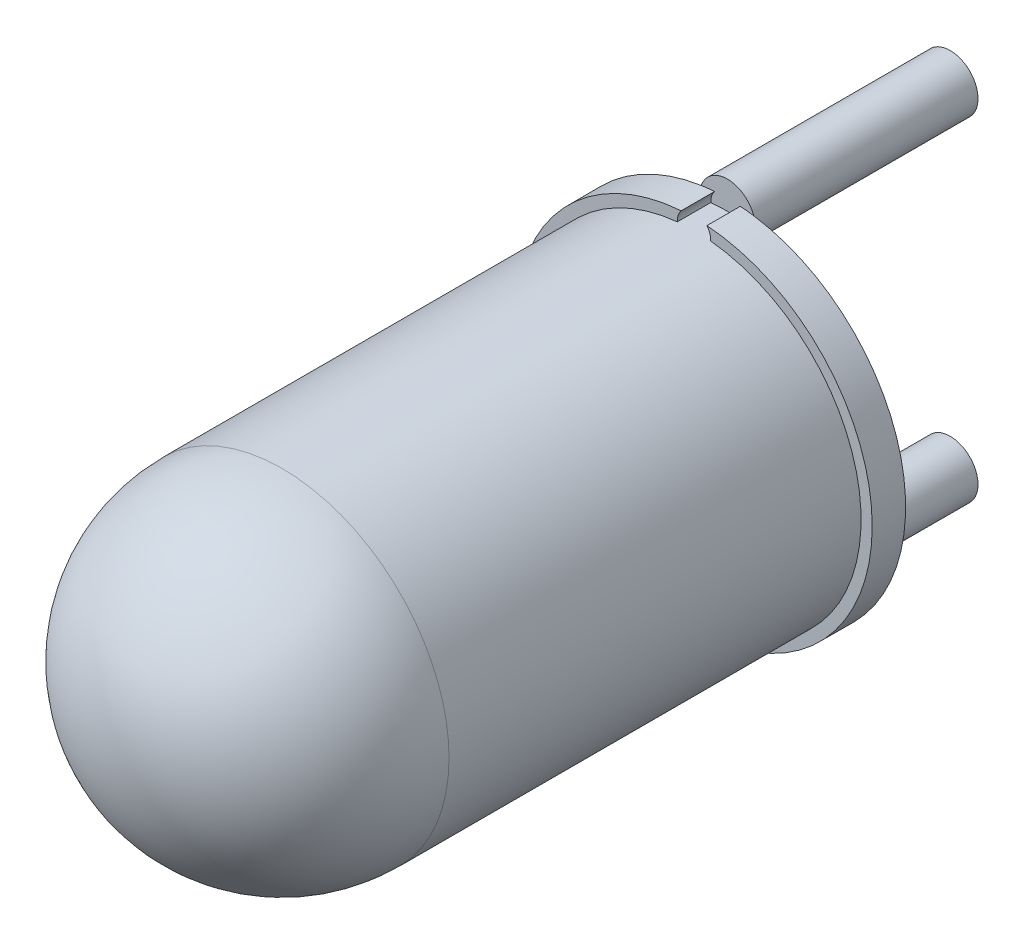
ISO-10303-21;
HEADER;
FILE_DESCRIPTION(('STEP AP214'),'2;1');
FILE_NAME('part.step','',(''),(''),'','','');
FILE_SCHEMA(('AUTOMOTIVE_DESIGN { 1 0 10303 214 1 1 1 1 }'));
ENDSEC;
DATA;
#1=APPLICATION_CONTEXT('core data for automotive mechanical design processes');
#2=APPLICATION_PROTOCOL_DEFINITION('international standard','automotive_design',2000,#1);
#3=PRODUCT_CONTEXT('',#1,'mechanical');
#4=PRODUCT('Part','Part','',(#3));
#5=PRODUCT_RELATED_PRODUCT_CATEGORY('part','',(#4));
#6=PRODUCT_DEFINITION_FORMATION('','',#4);
#7=PRODUCT_DEFINITION_CONTEXT('part definition',#1,'design');
#8=PRODUCT_DEFINITION('design','',#6,#7);
#9=PRODUCT_DEFINITION_SHAPE('','',#8);
#10=(LENGTH_UNIT() NAMED_UNIT(*) SI_UNIT(.MILLI.,.METRE.));
#11=(NAMED_UNIT(*) PLANE_ANGLE_UNIT() SI_UNIT($,.RADIAN.));
#12=(NAMED_UNIT(*) SI_UNIT($,.STERADIAN.) SOLID_ANGLE_UNIT());
#13=UNCERTAINTY_MEASURE_WITH_UNIT(LENGTH_MEASURE(1.E-05),#10,'distance_accuracy_value','');
#14=(GEOMETRIC_REPRESENTATION_CONTEXT(3) GLOBAL_UNCERTAINTY_ASSIGNED_CONTEXT((#13)) GLOBAL_UNIT_ASSIGNED_CONTEXT((#10,
#11,#12)) REPRESENTATION_CONTEXT('',''));
#15=CARTESIAN_POINT('',(0.,0.,0.));
#16=DIRECTION('',(0.,0.,1.));
#17=DIRECTION('',(1.,0.,0.));
#18=AXIS2_PLACEMENT_3D('',#15,#16,#17);
#19=CARTESIAN_POINT('',(0.,0.,4.));
#20=DIRECTION('',(0.,0.,-1.));
#21=DIRECTION('',(-1.,0.,0.));
#22=AXIS2_PLACEMENT_3D('',#19,#20,#21);
#23=CYLINDRICAL_SURFACE('',#22,1.5);
#24=CARTESIAN_POINT('',(0.,0.,4.));
#25=DIRECTION('',(0.,0.,1.));
#26=DIRECTION('',(1.,0.,0.));
#27=AXIS2_PLACEMENT_3D('',#24,#25,#26);
#28=CIRCLE('',#27,1.5);
#29=CARTESIAN_POINT('',(1.5,0.,4.));
#30=VERTEX_POINT('',#29);
#31=EDGE_CURVE('E162',#30,#30,#28,.T.);
#32=ORIENTED_EDGE('',*,*,#31,.F.);
#33=EDGE_LOOP('',(#32));
#34=FACE_BOUND('',#33,.T.);
#35=DIRECTION('',(0.,0.,-1.));
#36=VECTOR('',#35,1.);
#37=CARTESIAN_POINT('',(0.149812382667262,1.49249999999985,0.15));
#38=LINE('',#37,#36);
#39=CARTESIAN_POINT('',(0.149812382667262,1.49249999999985,0.));
#40=VERTEX_POINT('',#39);
#41=CARTESIAN_POINT('',(0.149812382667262,1.49249999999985,0.3));
#42=VERTEX_POINT('',#41);
#43=EDGE_CURVE('E178',#40,#42,#38,.F.);
#44=ORIENTED_EDGE('',*,*,#43,.F.);
#45=CARTESIAN_POINT('',(0.,0.,0.));
#46=DIRECTION('',(0.,0.,1.));
#47=DIRECTION('',(1.,0.,0.));
#48=AXIS2_PLACEMENT_3D('',#45,#46,#47);
#49=CIRCLE('',#48,1.5);
#50=CARTESIAN_POINT('',(-0.149812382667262,1.49249999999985,0.));
#51=VERTEX_POINT('',#50);
#52=EDGE_CURVE('E163',#40,#51,#49,.T.);
#53=ORIENTED_EDGE('',*,*,#52,.T.);
#54=DIRECTION('',(0.,0.,-1.));
#55=VECTOR('',#54,1.);
#56=CARTESIAN_POINT('',(-0.149812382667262,1.49249999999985,0.15));
#57=LINE('',#56,#55);
#58=CARTESIAN_POINT('',(-0.149812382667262,1.49249999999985,0.3));
#59=VERTEX_POINT('',#58);
#60=EDGE_CURVE('E181',#59,#51,#57,.T.);
#61=ORIENTED_EDGE('',*,*,#60,.F.);
#62=CARTESIAN_POINT('',(0.,0.,0.3));
#63=DIRECTION('',(0.,0.,-1.));
#64=DIRECTION('',(-1.,0.,0.));
#65=AXIS2_PLACEMENT_3D('',#62,#63,#64);
#66=CIRCLE('',#65,1.5);
#67=CARTESIAN_POINT('',(-0.149812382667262,-1.49249999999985,0.3));
#68=VERTEX_POINT('',#67);
#69=EDGE_CURVE('E11',#68,#59,#66,.T.);
#70=ORIENTED_EDGE('',*,*,#69,.F.);
#71=DIRECTION('',(0.,0.,-1.));
#72=VECTOR('',#71,1.);
#73=CARTESIAN_POINT('',(-0.149812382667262,-1.49249999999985,0.15));
#74=LINE('',#73,#72);
#75=CARTESIAN_POINT('',(-0.149812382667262,-1.49249999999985,0.));
#76=VERTEX_POINT('',#75);
#77=EDGE_CURVE('E153',#76,#68,#74,.F.);
#78=ORIENTED_EDGE('',*,*,#77,.F.);
#79=CARTESIAN_POINT('',(0.149812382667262,-1.49249999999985,0.));
#80=VERTEX_POINT('',#79);
#81=EDGE_CURVE('E158',#76,#80,#49,.T.);
#82=ORIENTED_EDGE('',*,*,#81,.T.);
#83=DIRECTION('',(0.,0.,-1.));
#84=VECTOR('',#83,1.);
#85=CARTESIAN_POINT('',(0.149812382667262,-1.49249999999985,0.15));
#86=LINE('',#85,#84);
#87=CARTESIAN_POINT('',(0.149812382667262,-1.49249999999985,0.3));
#88=VERTEX_POINT('',#87);
#89=EDGE_CURVE('E109',#88,#80,#86,.T.);
#90=ORIENTED_EDGE('',*,*,#89,.F.);
#91=EDGE_CURVE('E32',#42,#88,#66,.T.);
#92=ORIENTED_EDGE('',*,*,#91,.F.);
#93=EDGE_LOOP('',(#44,#53,#61,#70,#78,#82,#90,#92));
#94=FACE_BOUND('',#93,.T.);
#95=ADVANCED_FACE('F29',(#34,#94),#23,.T.);
#96=CARTESIAN_POINT('',(0.,1.5,0.));
#97=DIRECTION('',(0.,0.,-1.));
#98=DIRECTION('',(-1.,0.,0.));
#99=AXIS2_PLACEMENT_3D('',#96,#97,#98);
#100=PLANE('',#99);
#101=CARTESIAN_POINT('',(0.,1.5,0.));
#102=DIRECTION('',(0.,0.,-1.));
#103=DIRECTION('',(-1.,0.,0.));
#104=AXIS2_PLACEMENT_3D('',#101,#102,#103);
#105=CIRCLE('',#104,0.150000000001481);
#106=CARTESIAN_POINT('',(0.115394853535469,1.59583333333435,0.));
#107=VERTEX_POINT('',#106);
#108=EDGE_CURVE('E196',#107,#40,#105,.T.);
#109=ORIENTED_EDGE('',*,*,#108,.F.);
#110=CARTESIAN_POINT('',(0.,0.,0.));
#111=DIRECTION('',(0.,0.,-1.));
#112=DIRECTION('',(-1.,0.,0.));
#113=AXIS2_PLACEMENT_3D('',#110,#111,#112);
#114=CIRCLE('',#113,1.60000000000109);
#115=CARTESIAN_POINT('',(0.235995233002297,1.58250000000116,0.));
#116=VERTEX_POINT('',#115);
#117=EDGE_CURVE('E115',#107,#116,#114,.T.);
#118=ORIENTED_EDGE('',*,*,#117,.T.);
#119=CARTESIAN_POINT('',(0.,1.5,0.));
#120=DIRECTION('',(0.,0.,-1.));
#121=DIRECTION('',(-1.,0.,0.));
#122=AXIS2_PLACEMENT_3D('',#119,#120,#121);
#123=CIRCLE('',#122,0.25);
#124=CARTESIAN_POINT('',(-0.235995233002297,1.58250000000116,0.));
#125=VERTEX_POINT('',#124);
#126=EDGE_CURVE('E160',#125,#116,#123,.T.);
#127=ORIENTED_EDGE('',*,*,#126,.F.);
#128=CARTESIAN_POINT('',(-0.11539485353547,1.59583333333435,0.));
#129=VERTEX_POINT('',#128);
#130=EDGE_CURVE('E139',#125,#129,#114,.T.);
#131=ORIENTED_EDGE('',*,*,#130,.T.);
#132=EDGE_CURVE('E143',#51,#129,#105,.T.);
#133=ORIENTED_EDGE('',*,*,#132,.F.);
#134=ORIENTED_EDGE('',*,*,#52,.F.);
#135=EDGE_LOOP('',(#109,#118,#127,#131,#133,#134));
#136=FACE_BOUND('',#135,.T.);
#137=ADVANCED_FACE('F209',(#136),#100,.F.);
#138=CARTESIAN_POINT('',(0.,0.,0.));
#139=DIRECTION('',(0.,0.,1.));
#140=DIRECTION('',(1.,0.,0.));
#141=AXIS2_PLACEMENT_3D('',#138,#139,#140);
#142=PLANE('',#141);
#143=EDGE_CURVE('E42',#116,#125,#123,.T.);
#144=ORIENTED_EDGE('',*,*,#143,.F.);
#145=CARTESIAN_POINT('',(0.235995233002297,-1.58250000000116,0.));
#146=VERTEX_POINT('',#145);
#147=EDGE_CURVE('E134',#116,#146,#114,.T.);
#148=ORIENTED_EDGE('',*,*,#147,.T.);
#149=CARTESIAN_POINT('',(0.,-1.5,0.));
#150=DIRECTION('',(0.,0.,-1.));
#151=DIRECTION('',(-1.,0.,0.));
#152=AXIS2_PLACEMENT_3D('',#149,#150,#151);
#153=CIRCLE('',#152,0.25);
#154=CARTESIAN_POINT('',(-0.235995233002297,-1.58250000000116,0.));
#155=VERTEX_POINT('',#154);
#156=EDGE_CURVE('E171',#155,#146,#153,.T.);
#157=ORIENTED_EDGE('',*,*,#156,.F.);
#158=EDGE_CURVE('E136',#155,#125,#114,.T.);
#159=ORIENTED_EDGE('',*,*,#158,.T.);
#160=EDGE_LOOP('',(#144,#148,#157,#159));
#161=FACE_BOUND('',#160,.T.);
#162=ADVANCED_FACE('F234',(#161),#142,.F.);
#163=CARTESIAN_POINT('',(0.,0.,4.));
#164=DIRECTION('',(0.,0.,1.));
#165=DIRECTION('',(1.,0.,0.));
#166=AXIS2_PLACEMENT_3D('',#163,#164,#165);
#167=SPHERICAL_SURFACE('',#166,1.5);
#168=ORIENTED_EDGE('',*,*,#31,.T.);
#169=EDGE_LOOP('',(#168));
#170=FACE_BOUND('',#169,.T.);
#171=ADVANCED_FACE('F238',(#170),#167,.T.);
#172=CARTESIAN_POINT('',(0.,-1.5,-2.));
#173=DIRECTION('',(0.,0.,1.));
#174=DIRECTION('',(1.,0.,0.));
#175=AXIS2_PLACEMENT_3D('',#172,#173,#174);
#176=CYLINDRICAL_SURFACE('',#175,0.25);
#177=CARTESIAN_POINT('',(0.,-1.5,-2.));
#178=DIRECTION('',(0.,0.,-1.));
#179=DIRECTION('',(-1.,0.,0.));
#180=AXIS2_PLACEMENT_3D('',#177,#178,#179);
#181=CIRCLE('',#180,0.25);
#182=CARTESIAN_POINT('',(-0.25,-1.5,-2.));
#183=VERTEX_POINT('',#182);
#184=EDGE_CURVE('E167',#183,#183,#181,.T.);
#185=ORIENTED_EDGE('',*,*,#184,.F.);
#186=EDGE_LOOP('',(#185));
#187=FACE_BOUND('',#186,.T.);
#188=ORIENTED_EDGE('',*,*,#156,.T.);
#189=EDGE_CURVE('E133',#146,#155,#153,.T.);
#190=ORIENTED_EDGE('',*,*,#189,.T.);
#191=EDGE_LOOP('',(#188,#190));
#192=FACE_BOUND('',#191,.T.);
#193=ADVANCED_FACE('F225',(#187,#192),#176,.T.);
#194=CARTESIAN_POINT('',(0.,-1.5,-2.));
#195=DIRECTION('',(0.,0.,-1.));
#196=DIRECTION('',(-1.,0.,0.));
#197=AXIS2_PLACEMENT_3D('',#194,#195,#196);
#198=PLANE('',#197);
#199=ORIENTED_EDGE('',*,*,#184,.T.);
#200=EDGE_LOOP('',(#199));
#201=FACE_BOUND('',#200,.T.);
#202=ADVANCED_FACE('F223',(#201),#198,.T.);
#203=CARTESIAN_POINT('',(0.,-1.5,0.));
#204=DIRECTION('',(0.,0.,-1.));
#205=DIRECTION('',(-1.,0.,0.));
#206=AXIS2_PLACEMENT_3D('',#203,#204,#205);
#207=PLANE('',#206);
#208=CARTESIAN_POINT('',(0.,-1.5,0.));
#209=DIRECTION('',(0.,0.,-1.));
#210=DIRECTION('',(-1.,0.,0.));
#211=AXIS2_PLACEMENT_3D('',#208,#209,#210);
#212=CIRCLE('',#211,0.150000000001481);
#213=CARTESIAN_POINT('',(-0.115394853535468,-1.59583333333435,0.));
#214=VERTEX_POINT('',#213);
#215=EDGE_CURVE('E114',#214,#76,#212,.T.);
#216=ORIENTED_EDGE('',*,*,#215,.F.);
#217=EDGE_CURVE('E137',#214,#155,#114,.T.);
#218=ORIENTED_EDGE('',*,*,#217,.T.);
#219=ORIENTED_EDGE('',*,*,#189,.F.);
#220=CARTESIAN_POINT('',(0.115394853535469,-1.59583333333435,0.));
#221=VERTEX_POINT('',#220);
#222=EDGE_CURVE('E121',#146,#221,#114,.T.);
#223=ORIENTED_EDGE('',*,*,#222,.T.);
#224=EDGE_CURVE('E103',#80,#221,#212,.T.);
#225=ORIENTED_EDGE('',*,*,#224,.F.);
#226=ORIENTED_EDGE('',*,*,#81,.F.);
#227=EDGE_LOOP('',(#216,#218,#219,#223,#225,#226));
#228=FACE_BOUND('',#227,.T.);
#229=ADVANCED_FACE('F130',(#228),#207,.F.);
#230=CARTESIAN_POINT('',(0.,1.5,-2.));
#231=DIRECTION('',(0.,0.,1.));
#232=DIRECTION('',(1.,0.,0.));
#233=AXIS2_PLACEMENT_3D('',#230,#231,#232);
#234=CYLINDRICAL_SURFACE('',#233,0.25);
#235=CARTESIAN_POINT('',(0.,1.5,-2.));
#236=DIRECTION('',(0.,0.,-1.));
#237=DIRECTION('',(-1.,0.,0.));
#238=AXIS2_PLACEMENT_3D('',#235,#236,#237);
#239=CIRCLE('',#238,0.25);
#240=CARTESIAN_POINT('',(-0.25,1.5,-2.));
#241=VERTEX_POINT('',#240);
#242=EDGE_CURVE('E173',#241,#241,#239,.T.);
#243=ORIENTED_EDGE('',*,*,#242,.F.);
#244=EDGE_LOOP('',(#243));
#245=FACE_BOUND('',#244,.T.);
#246=ORIENTED_EDGE('',*,*,#143,.T.);
#247=ORIENTED_EDGE('',*,*,#126,.T.);
#248=EDGE_LOOP('',(#246,#247));
#249=FACE_BOUND('',#248,.T.);
#250=ADVANCED_FACE('F212',(#245,#249),#234,.T.);
#251=CARTESIAN_POINT('',(0.,1.5,-2.));
#252=DIRECTION('',(0.,0.,-1.));
#253=DIRECTION('',(-1.,0.,0.));
#254=AXIS2_PLACEMENT_3D('',#251,#252,#253);
#255=PLANE('',#254);
#256=ORIENTED_EDGE('',*,*,#242,.T.);
#257=EDGE_LOOP('',(#256));
#258=FACE_BOUND('',#257,.T.);
#259=ADVANCED_FACE('F214',(#258),#255,.T.);
#260=CARTESIAN_POINT('',(0.,0.,0.3));
#261=DIRECTION('',(0.,0.,-1.));
#262=DIRECTION('',(-1.,0.,0.));
#263=AXIS2_PLACEMENT_3D('',#260,#261,#262);
#264=CYLINDRICAL_SURFACE('',#263,1.60000000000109);
#265=DIRECTION('',(0.,0.,-1.));
#266=VECTOR('',#265,1.);
#267=CARTESIAN_POINT('',(-0.115394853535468,-1.59583333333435,0.3));
#268=LINE('',#267,#266);
#269=CARTESIAN_POINT('',(-0.115394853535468,-1.59583333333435,0.3));
#270=VERTEX_POINT('',#269);
#271=EDGE_CURVE('E125',#270,#214,#268,.T.);
#272=ORIENTED_EDGE('',*,*,#271,.F.);
#273=CARTESIAN_POINT('',(0.,0.,0.3));
#274=DIRECTION('',(0.,0.,-1.));
#275=DIRECTION('',(-1.,0.,0.));
#276=AXIS2_PLACEMENT_3D('',#273,#274,#275);
#277=CIRCLE('',#276,1.60000000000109);
#278=CARTESIAN_POINT('',(-0.11539485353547,1.59583333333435,0.3));
#279=VERTEX_POINT('',#278);
#280=EDGE_CURVE('E191',#270,#279,#277,.T.);
#281=ORIENTED_EDGE('',*,*,#280,.T.);
#282=DIRECTION('',(0.,0.,-1.));
#283=VECTOR('',#282,1.);
#284=CARTESIAN_POINT('',(-0.11539485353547,1.59583333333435,0.3));
#285=LINE('',#284,#283);
#286=EDGE_CURVE('E185',#279,#129,#285,.T.);
#287=ORIENTED_EDGE('',*,*,#286,.T.);
#288=ORIENTED_EDGE('',*,*,#130,.F.);
#289=ORIENTED_EDGE('',*,*,#158,.F.);
#290=ORIENTED_EDGE('',*,*,#217,.F.);
#291=EDGE_LOOP('',(#272,#281,#287,#288,#289,#290));
#292=FACE_BOUND('',#291,.T.);
#293=ADVANCED_FACE('F205',(#292),#264,.T.);
#294=CARTESIAN_POINT('',(0.,1.5,0.3));
#295=DIRECTION('',(0.,0.,-1.));
#296=DIRECTION('',(-1.,0.,0.));
#297=AXIS2_PLACEMENT_3D('',#294,#295,#296);
#298=CYLINDRICAL_SURFACE('',#297,0.150000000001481);
#299=CARTESIAN_POINT('',(0.,1.5,0.3));
#300=DIRECTION('',(0.,0.,-1.));
#301=DIRECTION('',(-1.,0.,0.));
#302=AXIS2_PLACEMENT_3D('',#299,#300,#301);
#303=CIRCLE('',#302,0.150000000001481);
#304=EDGE_CURVE('E190',#59,#279,#303,.T.);
#305=ORIENTED_EDGE('',*,*,#304,.F.);
#306=ORIENTED_EDGE('',*,*,#60,.T.);
#307=ORIENTED_EDGE('',*,*,#132,.T.);
#308=ORIENTED_EDGE('',*,*,#286,.F.);
#309=EDGE_LOOP('',(#305,#306,#307,#308));
#310=FACE_BOUND('',#309,.T.);
#311=ADVANCED_FACE('F202',(#310),#298,.F.);
#312=CARTESIAN_POINT('',(0.,-1.5,0.3));
#313=DIRECTION('',(0.,0.,-1.));
#314=DIRECTION('',(-1.,0.,0.));
#315=AXIS2_PLACEMENT_3D('',#312,#313,#314);
#316=CYLINDRICAL_SURFACE('',#315,0.150000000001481);
#317=ORIENTED_EDGE('',*,*,#215,.T.);
#318=ORIENTED_EDGE('',*,*,#77,.T.);
#319=CARTESIAN_POINT('',(0.,-1.5,0.3));
#320=DIRECTION('',(0.,0.,-1.));
#321=DIRECTION('',(-1.,0.,0.));
#322=AXIS2_PLACEMENT_3D('',#319,#320,#321);
#323=CIRCLE('',#322,0.150000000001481);
#324=EDGE_CURVE('E194',#270,#68,#323,.T.);
#325=ORIENTED_EDGE('',*,*,#324,.F.);
#326=ORIENTED_EDGE('',*,*,#271,.T.);
#327=EDGE_LOOP('',(#317,#318,#325,#326));
#328=FACE_BOUND('',#327,.T.);
#329=ADVANCED_FACE('F151',(#328),#316,.F.);
#330=CARTESIAN_POINT('',(0.,-0.75,0.3));
#331=DIRECTION('',(0.,0.,-1.));
#332=DIRECTION('',(-1.,0.,0.));
#333=AXIS2_PLACEMENT_3D('',#330,#331,#332);
#334=PLANE('',#333);
#335=ORIENTED_EDGE('',*,*,#324,.T.);
#336=ORIENTED_EDGE('',*,*,#69,.T.);
#337=ORIENTED_EDGE('',*,*,#304,.T.);
#338=ORIENTED_EDGE('',*,*,#280,.F.);
#339=EDGE_LOOP('',(#335,#336,#337,#338));
#340=FACE_BOUND('',#339,.T.);
#341=ADVANCED_FACE('F208',(#340),#334,.F.);
#342=CARTESIAN_POINT('',(0.115394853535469,1.59583333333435,0.3));
#343=VERTEX_POINT('',#342);
#344=EDGE_CURVE('E126',#343,#42,#303,.T.);
#345=ORIENTED_EDGE('',*,*,#344,.T.);
#346=ORIENTED_EDGE('',*,*,#91,.T.);
#347=CARTESIAN_POINT('',(0.115394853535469,-1.59583333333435,0.3));
#348=VERTEX_POINT('',#347);
#349=EDGE_CURVE('E195',#88,#348,#323,.T.);
#350=ORIENTED_EDGE('',*,*,#349,.T.);
#351=EDGE_CURVE('E124',#343,#348,#277,.T.);
#352=ORIENTED_EDGE('',*,*,#351,.F.);
#353=EDGE_LOOP('',(#345,#346,#350,#352));
#354=FACE_BOUND('',#353,.T.);
#355=ADVANCED_FACE('F304',(#354),#334,.F.);
#356=ORIENTED_EDGE('',*,*,#349,.F.);
#357=ORIENTED_EDGE('',*,*,#89,.T.);
#358=ORIENTED_EDGE('',*,*,#224,.T.);
#359=DIRECTION('',(0.,0.,-1.));
#360=VECTOR('',#359,1.);
#361=CARTESIAN_POINT('',(0.115394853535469,-1.59583333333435,0.3));
#362=LINE('',#361,#360);
#363=EDGE_CURVE('E106',#348,#221,#362,.T.);
#364=ORIENTED_EDGE('',*,*,#363,.F.);
#365=EDGE_LOOP('',(#356,#357,#358,#364));
#366=FACE_BOUND('',#365,.T.);
#367=ADVANCED_FACE('F105',(#366),#316,.F.);
#368=ORIENTED_EDGE('',*,*,#108,.T.);
#369=ORIENTED_EDGE('',*,*,#43,.T.);
#370=ORIENTED_EDGE('',*,*,#344,.F.);
#371=DIRECTION('',(0.,0.,-1.));
#372=VECTOR('',#371,1.);
#373=CARTESIAN_POINT('',(0.115394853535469,1.59583333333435,0.3));
#374=LINE('',#373,#372);
#375=EDGE_CURVE('E183',#343,#107,#374,.T.);
#376=ORIENTED_EDGE('',*,*,#375,.T.);
#377=EDGE_LOOP('',(#368,#369,#370,#376));
#378=FACE_BOUND('',#377,.T.);
#379=ADVANCED_FACE('F288',(#378),#298,.F.);
#380=ORIENTED_EDGE('',*,*,#375,.F.);
#381=ORIENTED_EDGE('',*,*,#351,.T.);
#382=ORIENTED_EDGE('',*,*,#363,.T.);
#383=ORIENTED_EDGE('',*,*,#222,.F.);
#384=ORIENTED_EDGE('',*,*,#147,.F.);
#385=ORIENTED_EDGE('',*,*,#117,.F.);
#386=EDGE_LOOP('',(#380,#381,#382,#383,#384,#385));
#387=FACE_BOUND('',#386,.T.);
#388=ADVANCED_FACE('F119',(#387),#264,.T.);
#389=CLOSED_SHELL('',(#95,#137,#162,#171,#193,#202,#229,#250,#259,#293,#311,#329,#341,#355,#367,
#379,#388));
#390=MANIFOLD_SOLID_BREP('B2',#389);
#391=ADVANCED_BREP_SHAPE_REPRESENTATION('',(#18,#390),#14);
#392=SHAPE_DEFINITION_REPRESENTATION(#9,#391);
ENDSEC;
END-ISO-10303-21;
